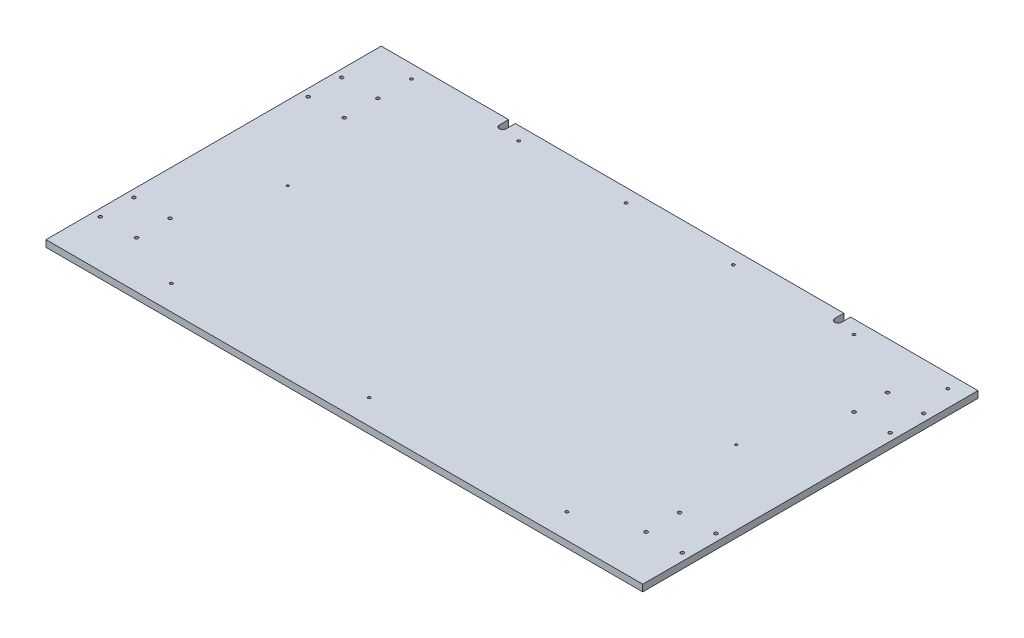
ISO-10303-21;
HEADER;
FILE_DESCRIPTION(('STEP AP214'),'2;1');
FILE_NAME('part.step','',(''),(''),'','','');
FILE_SCHEMA(('AUTOMOTIVE_DESIGN { 1 0 10303 214 1 1 1 1 }'));
ENDSEC;
DATA;
#1=APPLICATION_CONTEXT('core data for automotive mechanical design processes');
#2=APPLICATION_PROTOCOL_DEFINITION('international standard','automotive_design',2000,#1);
#3=PRODUCT_CONTEXT('',#1,'mechanical');
#4=PRODUCT('Part','Part','',(#3));
#5=PRODUCT_RELATED_PRODUCT_CATEGORY('part','',(#4));
#6=PRODUCT_DEFINITION_FORMATION('','',#4);
#7=PRODUCT_DEFINITION_CONTEXT('part definition',#1,'design');
#8=PRODUCT_DEFINITION('design','',#6,#7);
#9=PRODUCT_DEFINITION_SHAPE('','',#8);
#10=(LENGTH_UNIT() NAMED_UNIT(*) SI_UNIT(.MILLI.,.METRE.));
#11=(NAMED_UNIT(*) PLANE_ANGLE_UNIT() SI_UNIT($,.RADIAN.));
#12=(NAMED_UNIT(*) SI_UNIT($,.STERADIAN.) SOLID_ANGLE_UNIT());
#13=UNCERTAINTY_MEASURE_WITH_UNIT(LENGTH_MEASURE(1.E-05),#10,'distance_accuracy_value','');
#14=(GEOMETRIC_REPRESENTATION_CONTEXT(3) GLOBAL_UNCERTAINTY_ASSIGNED_CONTEXT((#13)) GLOBAL_UNIT_ASSIGNED_CONTEXT((#10,
#11,#12)) REPRESENTATION_CONTEXT('',''));
#15=CARTESIAN_POINT('',(0.,0.,0.));
#16=DIRECTION('',(0.,0.,1.));
#17=DIRECTION('',(1.,0.,0.));
#18=AXIS2_PLACEMENT_3D('',#15,#16,#17);
#19=CARTESIAN_POINT('',(0.,10.,0.));
#20=DIRECTION('',(0.,-1.,0.));
#21=DIRECTION('',(0.,0.,-1.));
#22=AXIS2_PLACEMENT_3D('',#19,#20,#21);
#23=PLANE('',#22);
#24=CARTESIAN_POINT('',(-334.5,10.,0.));
#25=DIRECTION('',(0.,1.,0.));
#26=DIRECTION('',(0.,0.,1.));
#27=AXIS2_PLACEMENT_3D('',#24,#25,#26);
#28=CIRCLE('',#27,1.64999999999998);
#29=CARTESIAN_POINT('',(-334.5,10.,1.64999999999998));
#30=VERTEX_POINT('',#29);
#31=EDGE_CURVE('E325',#30,#30,#28,.T.);
#32=ORIENTED_EDGE('',*,*,#31,.F.);
#33=EDGE_LOOP('',(#32));
#34=FACE_BOUND('',#33,.T.);
#35=CARTESIAN_POINT('',(334.5,10.,0.));
#36=DIRECTION('',(0.,1.,0.));
#37=DIRECTION('',(0.,0.,1.));
#38=AXIS2_PLACEMENT_3D('',#35,#36,#37);
#39=CIRCLE('',#38,1.64999999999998);
#40=CARTESIAN_POINT('',(334.5,10.,1.64999999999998));
#41=VERTEX_POINT('',#40);
#42=EDGE_CURVE('E331',#41,#41,#39,.T.);
#43=ORIENTED_EDGE('',*,*,#42,.F.);
#44=EDGE_LOOP('',(#43));
#45=FACE_BOUND('',#44,.T.);
#46=CARTESIAN_POINT('',(-60.0000000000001,10.,-230.));
#47=DIRECTION('',(0.,1.,0.));
#48=DIRECTION('',(0.,0.,1.));
#49=AXIS2_PLACEMENT_3D('',#46,#47,#48);
#50=CIRCLE('',#49,2.09999999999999);
#51=CARTESIAN_POINT('',(-60.0000000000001,10.,-227.9));
#52=VERTEX_POINT('',#51);
#53=EDGE_CURVE('E337',#52,#52,#50,.T.);
#54=ORIENTED_EDGE('',*,*,#53,.F.);
#55=EDGE_LOOP('',(#54));
#56=FACE_BOUND('',#55,.T.);
#57=CARTESIAN_POINT('',(99.9999999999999,10.,-230.));
#58=DIRECTION('',(0.,1.,0.));
#59=DIRECTION('',(0.,0.,1.));
#60=AXIS2_PLACEMENT_3D('',#57,#58,#59);
#61=CIRCLE('',#60,2.09999999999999);
#62=CARTESIAN_POINT('',(99.9999999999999,10.,-227.9));
#63=VERTEX_POINT('',#62);
#64=EDGE_CURVE('E343',#63,#63,#61,.T.);
#65=ORIENTED_EDGE('',*,*,#64,.F.);
#66=EDGE_LOOP('',(#65));
#67=FACE_BOUND('',#66,.T.);
#68=CARTESIAN_POINT('',(280.,10.,-230.));
#69=DIRECTION('',(0.,1.,0.));
#70=DIRECTION('',(0.,0.,1.));
#71=AXIS2_PLACEMENT_3D('',#68,#69,#70);
#72=CIRCLE('',#71,2.09999999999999);
#73=CARTESIAN_POINT('',(280.,10.,-227.9));
#74=VERTEX_POINT('',#73);
#75=EDGE_CURVE('E349',#74,#74,#72,.T.);
#76=ORIENTED_EDGE('',*,*,#75,.F.);
#77=EDGE_LOOP('',(#76));
#78=FACE_BOUND('',#77,.T.);
#79=CARTESIAN_POINT('',(420.,10.,-230.));
#80=DIRECTION('',(0.,1.,0.));
#81=DIRECTION('',(0.,0.,1.));
#82=AXIS2_PLACEMENT_3D('',#79,#80,#81);
#83=CIRCLE('',#82,2.09999999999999);
#84=CARTESIAN_POINT('',(420.,10.,-227.9));
#85=VERTEX_POINT('',#84);
#86=EDGE_CURVE('E355',#85,#85,#83,.T.);
#87=ORIENTED_EDGE('',*,*,#86,.F.);
#88=EDGE_LOOP('',(#87));
#89=FACE_BOUND('',#88,.T.);
#90=CARTESIAN_POINT('',(295.,10.,213.));
#91=DIRECTION('',(0.,1.,0.));
#92=DIRECTION('',(0.,0.,1.));
#93=AXIS2_PLACEMENT_3D('',#90,#91,#92);
#94=CIRCLE('',#93,2.09999999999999);
#95=CARTESIAN_POINT('',(295.,10.,215.1));
#96=VERTEX_POINT('',#95);
#97=EDGE_CURVE('E361',#96,#96,#94,.T.);
#98=ORIENTED_EDGE('',*,*,#97,.F.);
#99=EDGE_LOOP('',(#98));
#100=FACE_BOUND('',#99,.T.);
#101=CARTESIAN_POINT('',(0.,10.,213.));
#102=DIRECTION('',(0.,1.,0.));
#103=DIRECTION('',(0.,0.,1.));
#104=AXIS2_PLACEMENT_3D('',#101,#102,#103);
#105=CIRCLE('',#104,2.09999999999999);
#106=CARTESIAN_POINT('',(0.,10.,215.1));
#107=VERTEX_POINT('',#106);
#108=EDGE_CURVE('E367',#107,#107,#105,.T.);
#109=ORIENTED_EDGE('',*,*,#108,.F.);
#110=EDGE_LOOP('',(#109));
#111=FACE_BOUND('',#110,.T.);
#112=CARTESIAN_POINT('',(-220.,10.,-230.));
#113=DIRECTION('',(0.,1.,0.));
#114=DIRECTION('',(0.,0.,1.));
#115=AXIS2_PLACEMENT_3D('',#112,#113,#114);
#116=CIRCLE('',#115,2.09999999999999);
#117=CARTESIAN_POINT('',(-220.,10.,-227.9));
#118=VERTEX_POINT('',#117);
#119=EDGE_CURVE('E373',#118,#118,#116,.T.);
#120=ORIENTED_EDGE('',*,*,#119,.F.);
#121=EDGE_LOOP('',(#120));
#122=FACE_BOUND('',#121,.T.);
#123=CARTESIAN_POINT('',(-295.,10.,213.));
#124=DIRECTION('',(0.,1.,0.));
#125=DIRECTION('',(0.,0.,1.));
#126=AXIS2_PLACEMENT_3D('',#123,#124,#125);
#127=CIRCLE('',#126,2.09999999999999);
#128=CARTESIAN_POINT('',(-295.,10.,215.1));
#129=VERTEX_POINT('',#128);
#130=EDGE_CURVE('E379',#129,#129,#127,.T.);
#131=ORIENTED_EDGE('',*,*,#130,.F.);
#132=EDGE_LOOP('',(#131));
#133=FACE_BOUND('',#132,.T.);
#134=CARTESIAN_POINT('',(-380.,10.,-230.));
#135=DIRECTION('',(0.,1.,0.));
#136=DIRECTION('',(0.,0.,1.));
#137=AXIS2_PLACEMENT_3D('',#134,#135,#136);
#138=CIRCLE('',#137,2.09999999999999);
#139=CARTESIAN_POINT('',(-380.,10.,-227.9));
#140=VERTEX_POINT('',#139);
#141=EDGE_CURVE('E385',#140,#140,#138,.T.);
#142=ORIENTED_EDGE('',*,*,#141,.F.);
#143=EDGE_LOOP('',(#142));
#144=FACE_BOUND('',#143,.T.);
#145=CARTESIAN_POINT('',(-434.,10.,-180.));
#146=DIRECTION('',(0.,1.,0.));
#147=DIRECTION('',(0.,0.,1.));
#148=AXIS2_PLACEMENT_3D('',#145,#146,#147);
#149=CIRCLE('',#148,2.5);
#150=CARTESIAN_POINT('',(-434.,10.,-177.5));
#151=VERTEX_POINT('',#150);
#152=EDGE_CURVE('E391',#151,#151,#149,.T.);
#153=ORIENTED_EDGE('',*,*,#152,.F.);
#154=EDGE_LOOP('',(#153));
#155=FACE_BOUND('',#154,.T.);
#156=CARTESIAN_POINT('',(-380.,10.,-180.));
#157=DIRECTION('',(0.,1.,0.));
#158=DIRECTION('',(0.,0.,1.));
#159=AXIS2_PLACEMENT_3D('',#156,#157,#158);
#160=CIRCLE('',#159,2.5);
#161=CARTESIAN_POINT('',(-380.,10.,-177.5));
#162=VERTEX_POINT('',#161);
#163=EDGE_CURVE('E397',#162,#162,#160,.T.);
#164=ORIENTED_EDGE('',*,*,#163,.F.);
#165=EDGE_LOOP('',(#164));
#166=FACE_BOUND('',#165,.T.);
#167=CARTESIAN_POINT('',(-380.,10.,-130.));
#168=DIRECTION('',(0.,1.,0.));
#169=DIRECTION('',(0.,0.,1.));
#170=AXIS2_PLACEMENT_3D('',#167,#168,#169);
#171=CIRCLE('',#170,2.5);
#172=CARTESIAN_POINT('',(-380.,10.,-127.5));
#173=VERTEX_POINT('',#172);
#174=EDGE_CURVE('E403',#173,#173,#171,.T.);
#175=ORIENTED_EDGE('',*,*,#174,.F.);
#176=EDGE_LOOP('',(#175));
#177=FACE_BOUND('',#176,.T.);
#178=CARTESIAN_POINT('',(-434.,10.,-130.));
#179=DIRECTION('',(0.,1.,0.));
#180=DIRECTION('',(0.,0.,1.));
#181=AXIS2_PLACEMENT_3D('',#178,#179,#180);
#182=CIRCLE('',#181,2.5);
#183=CARTESIAN_POINT('',(-434.,10.,-127.5));
#184=VERTEX_POINT('',#183);
#185=EDGE_CURVE('E409',#184,#184,#182,.T.);
#186=ORIENTED_EDGE('',*,*,#185,.F.);
#187=EDGE_LOOP('',(#186));
#188=FACE_BOUND('',#187,.T.);
#189=CARTESIAN_POINT('',(-434.,10.,130.));
#190=DIRECTION('',(0.,1.,0.));
#191=DIRECTION('',(0.,0.,1.));
#192=AXIS2_PLACEMENT_3D('',#189,#190,#191);
#193=CIRCLE('',#192,2.5);
#194=CARTESIAN_POINT('',(-434.,10.,132.5));
#195=VERTEX_POINT('',#194);
#196=EDGE_CURVE('E415',#195,#195,#193,.T.);
#197=ORIENTED_EDGE('',*,*,#196,.F.);
#198=EDGE_LOOP('',(#197));
#199=FACE_BOUND('',#198,.T.);
#200=CARTESIAN_POINT('',(-380.,10.,130.));
#201=DIRECTION('',(0.,1.,0.));
#202=DIRECTION('',(0.,0.,1.));
#203=AXIS2_PLACEMENT_3D('',#200,#201,#202);
#204=CIRCLE('',#203,2.5);
#205=CARTESIAN_POINT('',(-380.,10.,132.5));
#206=VERTEX_POINT('',#205);
#207=EDGE_CURVE('E421',#206,#206,#204,.T.);
#208=ORIENTED_EDGE('',*,*,#207,.F.);
#209=EDGE_LOOP('',(#208));
#210=FACE_BOUND('',#209,.T.);
#211=CARTESIAN_POINT('',(-380.,10.,180.));
#212=DIRECTION('',(0.,1.,0.));
#213=DIRECTION('',(0.,0.,1.));
#214=AXIS2_PLACEMENT_3D('',#211,#212,#213);
#215=CIRCLE('',#214,2.5);
#216=CARTESIAN_POINT('',(-380.,10.,182.5));
#217=VERTEX_POINT('',#216);
#218=EDGE_CURVE('E427',#217,#217,#215,.T.);
#219=ORIENTED_EDGE('',*,*,#218,.F.);
#220=EDGE_LOOP('',(#219));
#221=FACE_BOUND('',#220,.T.);
#222=CARTESIAN_POINT('',(-434.,10.,180.));
#223=DIRECTION('',(0.,1.,0.));
#224=DIRECTION('',(0.,0.,1.));
#225=AXIS2_PLACEMENT_3D('',#222,#223,#224);
#226=CIRCLE('',#225,2.5);
#227=CARTESIAN_POINT('',(-434.,10.,182.5));
#228=VERTEX_POINT('',#227);
#229=EDGE_CURVE('E433',#228,#228,#226,.T.);
#230=ORIENTED_EDGE('',*,*,#229,.F.);
#231=EDGE_LOOP('',(#230));
#232=FACE_BOUND('',#231,.T.);
#233=CARTESIAN_POINT('',(434.,10.,180.));
#234=DIRECTION('',(0.,1.,0.));
#235=DIRECTION('',(0.,0.,1.));
#236=AXIS2_PLACEMENT_3D('',#233,#234,#235);
#237=CIRCLE('',#236,2.5);
#238=CARTESIAN_POINT('',(434.,10.,182.5));
#239=VERTEX_POINT('',#238);
#240=EDGE_CURVE('E439',#239,#239,#237,.T.);
#241=ORIENTED_EDGE('',*,*,#240,.F.);
#242=EDGE_LOOP('',(#241));
#243=FACE_BOUND('',#242,.T.);
#244=CARTESIAN_POINT('',(380.,10.,180.));
#245=DIRECTION('',(0.,1.,0.));
#246=DIRECTION('',(0.,0.,1.));
#247=AXIS2_PLACEMENT_3D('',#244,#245,#246);
#248=CIRCLE('',#247,2.5);
#249=CARTESIAN_POINT('',(380.,10.,182.5));
#250=VERTEX_POINT('',#249);
#251=EDGE_CURVE('E445',#250,#250,#248,.T.);
#252=ORIENTED_EDGE('',*,*,#251,.F.);
#253=EDGE_LOOP('',(#252));
#254=FACE_BOUND('',#253,.T.);
#255=CARTESIAN_POINT('',(380.,10.,130.));
#256=DIRECTION('',(0.,1.,0.));
#257=DIRECTION('',(0.,0.,1.));
#258=AXIS2_PLACEMENT_3D('',#255,#256,#257);
#259=CIRCLE('',#258,2.5);
#260=CARTESIAN_POINT('',(380.,10.,132.5));
#261=VERTEX_POINT('',#260);
#262=EDGE_CURVE('E451',#261,#261,#259,.T.);
#263=ORIENTED_EDGE('',*,*,#262,.F.);
#264=EDGE_LOOP('',(#263));
#265=FACE_BOUND('',#264,.T.);
#266=CARTESIAN_POINT('',(434.,10.,130.));
#267=DIRECTION('',(0.,1.,0.));
#268=DIRECTION('',(0.,0.,1.));
#269=AXIS2_PLACEMENT_3D('',#266,#267,#268);
#270=CIRCLE('',#269,2.5);
#271=CARTESIAN_POINT('',(434.,10.,132.5));
#272=VERTEX_POINT('',#271);
#273=EDGE_CURVE('E457',#272,#272,#270,.T.);
#274=ORIENTED_EDGE('',*,*,#273,.F.);
#275=EDGE_LOOP('',(#274));
#276=FACE_BOUND('',#275,.T.);
#277=CARTESIAN_POINT('',(434.,10.,-130.));
#278=DIRECTION('',(0.,1.,0.));
#279=DIRECTION('',(0.,0.,1.));
#280=AXIS2_PLACEMENT_3D('',#277,#278,#279);
#281=CIRCLE('',#280,2.5);
#282=CARTESIAN_POINT('',(434.,10.,-127.5));
#283=VERTEX_POINT('',#282);
#284=EDGE_CURVE('E463',#283,#283,#281,.T.);
#285=ORIENTED_EDGE('',*,*,#284,.F.);
#286=EDGE_LOOP('',(#285));
#287=FACE_BOUND('',#286,.T.);
#288=CARTESIAN_POINT('',(380.,10.,-130.));
#289=DIRECTION('',(0.,1.,0.));
#290=DIRECTION('',(0.,0.,1.));
#291=AXIS2_PLACEMENT_3D('',#288,#289,#290);
#292=CIRCLE('',#291,2.5);
#293=CARTESIAN_POINT('',(380.,10.,-127.5));
#294=VERTEX_POINT('',#293);
#295=EDGE_CURVE('E469',#294,#294,#292,.T.);
#296=ORIENTED_EDGE('',*,*,#295,.F.);
#297=EDGE_LOOP('',(#296));
#298=FACE_BOUND('',#297,.T.);
#299=CARTESIAN_POINT('',(380.,10.,-180.));
#300=DIRECTION('',(0.,1.,0.));
#301=DIRECTION('',(0.,0.,1.));
#302=AXIS2_PLACEMENT_3D('',#299,#300,#301);
#303=CIRCLE('',#302,2.5);
#304=CARTESIAN_POINT('',(380.,10.,-177.5));
#305=VERTEX_POINT('',#304);
#306=EDGE_CURVE('E475',#305,#305,#303,.T.);
#307=ORIENTED_EDGE('',*,*,#306,.F.);
#308=EDGE_LOOP('',(#307));
#309=FACE_BOUND('',#308,.T.);
#310=CARTESIAN_POINT('',(434.,10.,-180.));
#311=DIRECTION('',(0.,1.,0.));
#312=DIRECTION('',(0.,0.,1.));
#313=AXIS2_PLACEMENT_3D('',#310,#311,#312);
#314=CIRCLE('',#313,2.5);
#315=CARTESIAN_POINT('',(434.,10.,-177.5));
#316=VERTEX_POINT('',#315);
#317=EDGE_CURVE('E481',#316,#316,#314,.T.);
#318=ORIENTED_EDGE('',*,*,#317,.F.);
#319=EDGE_LOOP('',(#318));
#320=FACE_BOUND('',#319,.T.);
#321=DIRECTION('',(0.,0.,-1.));
#322=VECTOR('',#321,1.);
#323=CARTESIAN_POINT('',(-244.999999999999,9.99999999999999,-236.2));
#324=LINE('',#323,#322);
#325=CARTESIAN_POINT('',(-244.999999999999,9.99999999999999,-236.2));
#326=VERTEX_POINT('',#325);
#327=CARTESIAN_POINT('',(-244.999999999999,9.99999999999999,-250.));
#328=VERTEX_POINT('',#327);
#329=EDGE_CURVE('E283',#326,#328,#324,.T.);
#330=ORIENTED_EDGE('',*,*,#329,.F.);
#331=CARTESIAN_POINT('',(-249.999999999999,9.99999999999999,-236.2));
#332=DIRECTION('',(0.,-1.,0.));
#333=DIRECTION('',(0.,0.,-1.));
#334=AXIS2_PLACEMENT_3D('',#331,#332,#333);
#335=CIRCLE('',#334,4.99999999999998);
#336=CARTESIAN_POINT('',(-254.999999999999,10.,-236.2));
#337=VERTEX_POINT('',#336);
#338=EDGE_CURVE('E291',#326,#337,#335,.T.);
#339=ORIENTED_EDGE('',*,*,#338,.T.);
#340=DIRECTION('',(0.,0.,-1.));
#341=VECTOR('',#340,1.);
#342=CARTESIAN_POINT('',(-254.999999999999,10.,-236.2));
#343=LINE('',#342,#341);
#344=CARTESIAN_POINT('',(-254.999999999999,10.,-250.));
#345=VERTEX_POINT('',#344);
#346=EDGE_CURVE('E558',#337,#345,#343,.T.);
#347=ORIENTED_EDGE('',*,*,#346,.T.);
#348=DIRECTION('',(-1.,0.,0.));
#349=VECTOR('',#348,1.);
#350=CARTESIAN_POINT('',(445.,10.,-250.));
#351=LINE('',#350,#349);
#352=CARTESIAN_POINT('',(-445.,10.,-250.));
#353=VERTEX_POINT('',#352);
#354=EDGE_CURVE('E496',#345,#353,#351,.T.);
#355=ORIENTED_EDGE('',*,*,#354,.T.);
#356=DIRECTION('',(0.,0.,1.));
#357=VECTOR('',#356,1.);
#358=CARTESIAN_POINT('',(-445.,10.,-250.));
#359=LINE('',#358,#357);
#360=CARTESIAN_POINT('',(-445.,10.,250.));
#361=VERTEX_POINT('',#360);
#362=EDGE_CURVE('E488',#353,#361,#359,.T.);
#363=ORIENTED_EDGE('',*,*,#362,.T.);
#364=DIRECTION('',(1.,0.,0.));
#365=VECTOR('',#364,1.);
#366=CARTESIAN_POINT('',(445.,10.,250.));
#367=LINE('',#366,#365);
#368=CARTESIAN_POINT('',(445.,10.,250.));
#369=VERTEX_POINT('',#368);
#370=EDGE_CURVE('E491',#361,#369,#367,.T.);
#371=ORIENTED_EDGE('',*,*,#370,.T.);
#372=DIRECTION('',(0.,0.,-1.));
#373=VECTOR('',#372,1.);
#374=CARTESIAN_POINT('',(445.,10.,-250.));
#375=LINE('',#374,#373);
#376=CARTESIAN_POINT('',(445.,10.,-250.));
#377=VERTEX_POINT('',#376);
#378=EDGE_CURVE('E494',#369,#377,#375,.T.);
#379=ORIENTED_EDGE('',*,*,#378,.T.);
#380=CARTESIAN_POINT('',(255.000000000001,9.99999999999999,-250.));
#381=VERTEX_POINT('',#380);
#382=EDGE_CURVE('E497',#377,#381,#351,.T.);
#383=ORIENTED_EDGE('',*,*,#382,.T.);
#384=DIRECTION('',(0.,0.,-1.));
#385=VECTOR('',#384,1.);
#386=CARTESIAN_POINT('',(255.000000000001,9.99999999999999,-236.2));
#387=LINE('',#386,#385);
#388=CARTESIAN_POINT('',(255.000000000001,9.99999999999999,-236.2));
#389=VERTEX_POINT('',#388);
#390=EDGE_CURVE('E306',#389,#381,#387,.T.);
#391=ORIENTED_EDGE('',*,*,#390,.F.);
#392=CARTESIAN_POINT('',(250.000000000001,9.99999999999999,-236.2));
#393=DIRECTION('',(0.,-1.,0.));
#394=DIRECTION('',(0.,0.,-1.));
#395=AXIS2_PLACEMENT_3D('',#392,#393,#394);
#396=CIRCLE('',#395,5.);
#397=CARTESIAN_POINT('',(245.000000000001,10.,-236.2));
#398=VERTEX_POINT('',#397);
#399=EDGE_CURVE('E316',#389,#398,#396,.T.);
#400=ORIENTED_EDGE('',*,*,#399,.T.);
#401=DIRECTION('',(0.,0.,-1.));
#402=VECTOR('',#401,1.);
#403=CARTESIAN_POINT('',(245.000000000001,9.99999999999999,-236.2));
#404=LINE('',#403,#402);
#405=CARTESIAN_POINT('',(245.000000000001,9.99999999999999,-250.));
#406=VERTEX_POINT('',#405);
#407=EDGE_CURVE('E303',#398,#406,#404,.T.);
#408=ORIENTED_EDGE('',*,*,#407,.T.);
#409=EDGE_CURVE('E501',#406,#328,#351,.T.);
#410=ORIENTED_EDGE('',*,*,#409,.T.);
#411=EDGE_LOOP('',(#330,#339,#347,#355,#363,#371,#379,#383,#391,#400,#408,#410));
#412=FACE_BOUND('',#411,.T.);
#413=ADVANCED_FACE('F185',(#34,#45,#56,#67,#78,#89,#100,#111,#122,#133,#144,#155,#166,#177,#188,
#199,#210,#221,#232,#243,#254,#265,#276,#287,#298,#309,#320,#412),#23,.F.);
#414=CARTESIAN_POINT('',(445.,10.,-250.));
#415=DIRECTION('',(0.,0.,1.));
#416=DIRECTION('',(1.,0.,0.));
#417=AXIS2_PLACEMENT_3D('',#414,#415,#416);
#418=PLANE('',#417);
#419=DIRECTION('',(0.,-1.,0.));
#420=VECTOR('',#419,1.);
#421=CARTESIAN_POINT('',(-244.999999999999,10.,-250.));
#422=LINE('',#421,#420);
#423=CARTESIAN_POINT('',(-244.999999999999,0.,-250.));
#424=VERTEX_POINT('',#423);
#425=EDGE_CURVE('E13',#328,#424,#422,.T.);
#426=ORIENTED_EDGE('',*,*,#425,.F.);
#427=ORIENTED_EDGE('',*,*,#409,.F.);
#428=DIRECTION('',(0.,-1.,0.));
#429=VECTOR('',#428,1.);
#430=CARTESIAN_POINT('',(245.000000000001,10.,-250.));
#431=LINE('',#430,#429);
#432=CARTESIAN_POINT('',(245.000000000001,0.,-250.));
#433=VERTEX_POINT('',#432);
#434=EDGE_CURVE('E320',#406,#433,#431,.T.);
#435=ORIENTED_EDGE('',*,*,#434,.T.);
#436=DIRECTION('',(-1.,0.,0.));
#437=VECTOR('',#436,1.);
#438=CARTESIAN_POINT('',(445.,0.,-250.));
#439=LINE('',#438,#437);
#440=EDGE_CURVE('E511',#433,#424,#439,.T.);
#441=ORIENTED_EDGE('',*,*,#440,.T.);
#442=EDGE_LOOP('',(#426,#427,#435,#441));
#443=FACE_BOUND('',#442,.T.);
#444=ADVANCED_FACE('F529',(#443),#418,.F.);
#445=DIRECTION('',(0.,-1.,0.));
#446=VECTOR('',#445,1.);
#447=CARTESIAN_POINT('',(255.000000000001,10.,-250.));
#448=LINE('',#447,#446);
#449=CARTESIAN_POINT('',(255.000000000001,0.,-250.));
#450=VERTEX_POINT('',#449);
#451=EDGE_CURVE('E323',#381,#450,#448,.T.);
#452=ORIENTED_EDGE('',*,*,#451,.F.);
#453=ORIENTED_EDGE('',*,*,#382,.F.);
#454=DIRECTION('',(0.,-1.,0.));
#455=VECTOR('',#454,1.);
#456=CARTESIAN_POINT('',(445.,10.,-250.));
#457=LINE('',#456,#455);
#458=CARTESIAN_POINT('',(445.,0.,-250.));
#459=VERTEX_POINT('',#458);
#460=EDGE_CURVE('E514',#377,#459,#457,.T.);
#461=ORIENTED_EDGE('',*,*,#460,.T.);
#462=EDGE_CURVE('E492',#459,#450,#439,.T.);
#463=ORIENTED_EDGE('',*,*,#462,.T.);
#464=EDGE_LOOP('',(#452,#453,#461,#463));
#465=FACE_BOUND('',#464,.T.);
#466=ADVANCED_FACE('F547',(#465),#418,.F.);
#467=CARTESIAN_POINT('',(0.,0.,0.));
#468=DIRECTION('',(0.,-1.,0.));
#469=DIRECTION('',(0.,0.,-1.));
#470=AXIS2_PLACEMENT_3D('',#467,#468,#469);
#471=PLANE('',#470);
#472=DIRECTION('',(0.,0.,-1.));
#473=VECTOR('',#472,1.);
#474=CARTESIAN_POINT('',(-254.999999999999,0.,-236.2));
#475=LINE('',#474,#473);
#476=CARTESIAN_POINT('',(-254.999999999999,0.,-236.2));
#477=VERTEX_POINT('',#476);
#478=CARTESIAN_POINT('',(-254.999999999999,0.,-250.));
#479=VERTEX_POINT('',#478);
#480=EDGE_CURVE('E200',#477,#479,#475,.T.);
#481=ORIENTED_EDGE('',*,*,#480,.F.);
#482=CARTESIAN_POINT('',(-249.999999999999,0.,-236.2));
#483=DIRECTION('',(0.,-1.,0.));
#484=DIRECTION('',(0.,0.,-1.));
#485=AXIS2_PLACEMENT_3D('',#482,#483,#484);
#486=CIRCLE('',#485,4.99999999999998);
#487=CARTESIAN_POINT('',(-244.999999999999,0.,-236.2));
#488=VERTEX_POINT('',#487);
#489=EDGE_CURVE('E289',#488,#477,#486,.T.);
#490=ORIENTED_EDGE('',*,*,#489,.F.);
#491=DIRECTION('',(0.,0.,-1.));
#492=VECTOR('',#491,1.);
#493=CARTESIAN_POINT('',(-244.999999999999,0.,-236.2));
#494=LINE('',#493,#492);
#495=EDGE_CURVE('E273',#488,#424,#494,.T.);
#496=ORIENTED_EDGE('',*,*,#495,.T.);
#497=ORIENTED_EDGE('',*,*,#440,.F.);
#498=DIRECTION('',(0.,0.,-1.));
#499=VECTOR('',#498,1.);
#500=CARTESIAN_POINT('',(245.000000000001,0.,-236.2));
#501=LINE('',#500,#499);
#502=CARTESIAN_POINT('',(245.000000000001,0.,-236.2));
#503=VERTEX_POINT('',#502);
#504=EDGE_CURVE('E301',#503,#433,#501,.T.);
#505=ORIENTED_EDGE('',*,*,#504,.F.);
#506=CARTESIAN_POINT('',(250.000000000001,0.,-236.2));
#507=DIRECTION('',(0.,-1.,0.));
#508=DIRECTION('',(0.,0.,-1.));
#509=AXIS2_PLACEMENT_3D('',#506,#507,#508);
#510=CIRCLE('',#509,5.);
#511=CARTESIAN_POINT('',(255.000000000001,0.,-236.2));
#512=VERTEX_POINT('',#511);
#513=EDGE_CURVE('E314',#512,#503,#510,.T.);
#514=ORIENTED_EDGE('',*,*,#513,.F.);
#515=DIRECTION('',(0.,0.,-1.));
#516=VECTOR('',#515,1.);
#517=CARTESIAN_POINT('',(255.000000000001,0.,-236.2));
#518=LINE('',#517,#516);
#519=EDGE_CURVE('E308',#512,#450,#518,.T.);
#520=ORIENTED_EDGE('',*,*,#519,.T.);
#521=ORIENTED_EDGE('',*,*,#462,.F.);
#522=DIRECTION('',(0.,0.,-1.));
#523=VECTOR('',#522,1.);
#524=CARTESIAN_POINT('',(445.,0.,-250.));
#525=LINE('',#524,#523);
#526=CARTESIAN_POINT('',(445.,0.,250.));
#527=VERTEX_POINT('',#526);
#528=EDGE_CURVE('E506',#527,#459,#525,.T.);
#529=ORIENTED_EDGE('',*,*,#528,.F.);
#530=DIRECTION('',(1.,0.,0.));
#531=VECTOR('',#530,1.);
#532=CARTESIAN_POINT('',(445.,0.,250.));
#533=LINE('',#532,#531);
#534=CARTESIAN_POINT('',(-445.,0.,250.));
#535=VERTEX_POINT('',#534);
#536=EDGE_CURVE('E504',#535,#527,#533,.T.);
#537=ORIENTED_EDGE('',*,*,#536,.F.);
#538=DIRECTION('',(0.,0.,1.));
#539=VECTOR('',#538,1.);
#540=CARTESIAN_POINT('',(-445.,0.,-250.));
#541=LINE('',#540,#539);
#542=CARTESIAN_POINT('',(-445.,0.,-250.));
#543=VERTEX_POINT('',#542);
#544=EDGE_CURVE('E487',#543,#535,#541,.T.);
#545=ORIENTED_EDGE('',*,*,#544,.F.);
#546=EDGE_CURVE('E508',#479,#543,#439,.T.);
#547=ORIENTED_EDGE('',*,*,#546,.F.);
#548=EDGE_LOOP('',(#481,#490,#496,#497,#505,#514,#520,#521,#529,#537,#545,#547));
#549=FACE_BOUND('',#548,.T.);
#550=CARTESIAN_POINT('',(434.,0.,-180.));
#551=DIRECTION('',(0.,1.,0.));
#552=DIRECTION('',(0.,0.,1.));
#553=AXIS2_PLACEMENT_3D('',#550,#551,#552);
#554=CIRCLE('',#553,2.5);
#555=CARTESIAN_POINT('',(434.,0.,-177.5));
#556=VERTEX_POINT('',#555);
#557=EDGE_CURVE('E484',#556,#556,#554,.T.);
#558=ORIENTED_EDGE('',*,*,#557,.T.);
#559=EDGE_LOOP('',(#558));
#560=FACE_BOUND('',#559,.T.);
#561=CARTESIAN_POINT('',(380.,0.,-180.));
#562=DIRECTION('',(0.,1.,0.));
#563=DIRECTION('',(0.,0.,1.));
#564=AXIS2_PLACEMENT_3D('',#561,#562,#563);
#565=CIRCLE('',#564,2.5);
#566=CARTESIAN_POINT('',(380.,0.,-177.5));
#567=VERTEX_POINT('',#566);
#568=EDGE_CURVE('E478',#567,#567,#565,.T.);
#569=ORIENTED_EDGE('',*,*,#568,.T.);
#570=EDGE_LOOP('',(#569));
#571=FACE_BOUND('',#570,.T.);
#572=CARTESIAN_POINT('',(380.,0.,-130.));
#573=DIRECTION('',(0.,1.,0.));
#574=DIRECTION('',(0.,0.,1.));
#575=AXIS2_PLACEMENT_3D('',#572,#573,#574);
#576=CIRCLE('',#575,2.5);
#577=CARTESIAN_POINT('',(380.,0.,-127.5));
#578=VERTEX_POINT('',#577);
#579=EDGE_CURVE('E472',#578,#578,#576,.T.);
#580=ORIENTED_EDGE('',*,*,#579,.T.);
#581=EDGE_LOOP('',(#580));
#582=FACE_BOUND('',#581,.T.);
#583=CARTESIAN_POINT('',(434.,0.,-130.));
#584=DIRECTION('',(0.,1.,0.));
#585=DIRECTION('',(0.,0.,1.));
#586=AXIS2_PLACEMENT_3D('',#583,#584,#585);
#587=CIRCLE('',#586,2.5);
#588=CARTESIAN_POINT('',(434.,0.,-127.5));
#589=VERTEX_POINT('',#588);
#590=EDGE_CURVE('E466',#589,#589,#587,.T.);
#591=ORIENTED_EDGE('',*,*,#590,.T.);
#592=EDGE_LOOP('',(#591));
#593=FACE_BOUND('',#592,.T.);
#594=CARTESIAN_POINT('',(434.,0.,130.));
#595=DIRECTION('',(0.,1.,0.));
#596=DIRECTION('',(0.,0.,1.));
#597=AXIS2_PLACEMENT_3D('',#594,#595,#596);
#598=CIRCLE('',#597,2.5);
#599=CARTESIAN_POINT('',(434.,0.,132.5));
#600=VERTEX_POINT('',#599);
#601=EDGE_CURVE('E460',#600,#600,#598,.T.);
#602=ORIENTED_EDGE('',*,*,#601,.T.);
#603=EDGE_LOOP('',(#602));
#604=FACE_BOUND('',#603,.T.);
#605=CARTESIAN_POINT('',(380.,0.,130.));
#606=DIRECTION('',(0.,1.,0.));
#607=DIRECTION('',(0.,0.,1.));
#608=AXIS2_PLACEMENT_3D('',#605,#606,#607);
#609=CIRCLE('',#608,2.5);
#610=CARTESIAN_POINT('',(380.,0.,132.5));
#611=VERTEX_POINT('',#610);
#612=EDGE_CURVE('E454',#611,#611,#609,.T.);
#613=ORIENTED_EDGE('',*,*,#612,.T.);
#614=EDGE_LOOP('',(#613));
#615=FACE_BOUND('',#614,.T.);
#616=CARTESIAN_POINT('',(380.,0.,180.));
#617=DIRECTION('',(0.,1.,0.));
#618=DIRECTION('',(0.,0.,1.));
#619=AXIS2_PLACEMENT_3D('',#616,#617,#618);
#620=CIRCLE('',#619,2.5);
#621=CARTESIAN_POINT('',(380.,0.,182.5));
#622=VERTEX_POINT('',#621);
#623=EDGE_CURVE('E448',#622,#622,#620,.T.);
#624=ORIENTED_EDGE('',*,*,#623,.T.);
#625=EDGE_LOOP('',(#624));
#626=FACE_BOUND('',#625,.T.);
#627=CARTESIAN_POINT('',(434.,0.,180.));
#628=DIRECTION('',(0.,1.,0.));
#629=DIRECTION('',(0.,0.,1.));
#630=AXIS2_PLACEMENT_3D('',#627,#628,#629);
#631=CIRCLE('',#630,2.5);
#632=CARTESIAN_POINT('',(434.,0.,182.5));
#633=VERTEX_POINT('',#632);
#634=EDGE_CURVE('E442',#633,#633,#631,.T.);
#635=ORIENTED_EDGE('',*,*,#634,.T.);
#636=EDGE_LOOP('',(#635));
#637=FACE_BOUND('',#636,.T.);
#638=CARTESIAN_POINT('',(-434.,0.,180.));
#639=DIRECTION('',(0.,1.,0.));
#640=DIRECTION('',(0.,0.,1.));
#641=AXIS2_PLACEMENT_3D('',#638,#639,#640);
#642=CIRCLE('',#641,2.5);
#643=CARTESIAN_POINT('',(-434.,0.,182.5));
#644=VERTEX_POINT('',#643);
#645=EDGE_CURVE('E436',#644,#644,#642,.T.);
#646=ORIENTED_EDGE('',*,*,#645,.T.);
#647=EDGE_LOOP('',(#646));
#648=FACE_BOUND('',#647,.T.);
#649=CARTESIAN_POINT('',(-380.,0.,180.));
#650=DIRECTION('',(0.,1.,0.));
#651=DIRECTION('',(0.,0.,1.));
#652=AXIS2_PLACEMENT_3D('',#649,#650,#651);
#653=CIRCLE('',#652,2.5);
#654=CARTESIAN_POINT('',(-380.,0.,182.5));
#655=VERTEX_POINT('',#654);
#656=EDGE_CURVE('E430',#655,#655,#653,.T.);
#657=ORIENTED_EDGE('',*,*,#656,.T.);
#658=EDGE_LOOP('',(#657));
#659=FACE_BOUND('',#658,.T.);
#660=CARTESIAN_POINT('',(-380.,0.,130.));
#661=DIRECTION('',(0.,1.,0.));
#662=DIRECTION('',(0.,0.,1.));
#663=AXIS2_PLACEMENT_3D('',#660,#661,#662);
#664=CIRCLE('',#663,2.5);
#665=CARTESIAN_POINT('',(-380.,0.,132.5));
#666=VERTEX_POINT('',#665);
#667=EDGE_CURVE('E424',#666,#666,#664,.T.);
#668=ORIENTED_EDGE('',*,*,#667,.T.);
#669=EDGE_LOOP('',(#668));
#670=FACE_BOUND('',#669,.T.);
#671=CARTESIAN_POINT('',(-434.,0.,130.));
#672=DIRECTION('',(0.,1.,0.));
#673=DIRECTION('',(0.,0.,1.));
#674=AXIS2_PLACEMENT_3D('',#671,#672,#673);
#675=CIRCLE('',#674,2.5);
#676=CARTESIAN_POINT('',(-434.,0.,132.5));
#677=VERTEX_POINT('',#676);
#678=EDGE_CURVE('E418',#677,#677,#675,.T.);
#679=ORIENTED_EDGE('',*,*,#678,.T.);
#680=EDGE_LOOP('',(#679));
#681=FACE_BOUND('',#680,.T.);
#682=CARTESIAN_POINT('',(-434.,0.,-130.));
#683=DIRECTION('',(0.,1.,0.));
#684=DIRECTION('',(0.,0.,1.));
#685=AXIS2_PLACEMENT_3D('',#682,#683,#684);
#686=CIRCLE('',#685,2.5);
#687=CARTESIAN_POINT('',(-434.,0.,-127.5));
#688=VERTEX_POINT('',#687);
#689=EDGE_CURVE('E412',#688,#688,#686,.T.);
#690=ORIENTED_EDGE('',*,*,#689,.T.);
#691=EDGE_LOOP('',(#690));
#692=FACE_BOUND('',#691,.T.);
#693=CARTESIAN_POINT('',(-380.,0.,-130.));
#694=DIRECTION('',(0.,1.,0.));
#695=DIRECTION('',(0.,0.,1.));
#696=AXIS2_PLACEMENT_3D('',#693,#694,#695);
#697=CIRCLE('',#696,2.5);
#698=CARTESIAN_POINT('',(-380.,0.,-127.5));
#699=VERTEX_POINT('',#698);
#700=EDGE_CURVE('E406',#699,#699,#697,.T.);
#701=ORIENTED_EDGE('',*,*,#700,.T.);
#702=EDGE_LOOP('',(#701));
#703=FACE_BOUND('',#702,.T.);
#704=CARTESIAN_POINT('',(-380.,0.,-180.));
#705=DIRECTION('',(0.,1.,0.));
#706=DIRECTION('',(0.,0.,1.));
#707=AXIS2_PLACEMENT_3D('',#704,#705,#706);
#708=CIRCLE('',#707,2.5);
#709=CARTESIAN_POINT('',(-380.,0.,-177.5));
#710=VERTEX_POINT('',#709);
#711=EDGE_CURVE('E400',#710,#710,#708,.T.);
#712=ORIENTED_EDGE('',*,*,#711,.T.);
#713=EDGE_LOOP('',(#712));
#714=FACE_BOUND('',#713,.T.);
#715=CARTESIAN_POINT('',(-434.,0.,-180.));
#716=DIRECTION('',(0.,1.,0.));
#717=DIRECTION('',(0.,0.,1.));
#718=AXIS2_PLACEMENT_3D('',#715,#716,#717);
#719=CIRCLE('',#718,2.5);
#720=CARTESIAN_POINT('',(-434.,0.,-177.5));
#721=VERTEX_POINT('',#720);
#722=EDGE_CURVE('E394',#721,#721,#719,.T.);
#723=ORIENTED_EDGE('',*,*,#722,.T.);
#724=EDGE_LOOP('',(#723));
#725=FACE_BOUND('',#724,.T.);
#726=CARTESIAN_POINT('',(-380.,0.,-230.));
#727=DIRECTION('',(0.,1.,0.));
#728=DIRECTION('',(0.,0.,1.));
#729=AXIS2_PLACEMENT_3D('',#726,#727,#728);
#730=CIRCLE('',#729,2.09999999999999);
#731=CARTESIAN_POINT('',(-380.,0.,-227.9));
#732=VERTEX_POINT('',#731);
#733=EDGE_CURVE('E388',#732,#732,#730,.T.);
#734=ORIENTED_EDGE('',*,*,#733,.T.);
#735=EDGE_LOOP('',(#734));
#736=FACE_BOUND('',#735,.T.);
#737=CARTESIAN_POINT('',(-295.,0.,213.));
#738=DIRECTION('',(0.,1.,0.));
#739=DIRECTION('',(0.,0.,1.));
#740=AXIS2_PLACEMENT_3D('',#737,#738,#739);
#741=CIRCLE('',#740,2.09999999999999);
#742=CARTESIAN_POINT('',(-295.,0.,215.1));
#743=VERTEX_POINT('',#742);
#744=EDGE_CURVE('E382',#743,#743,#741,.T.);
#745=ORIENTED_EDGE('',*,*,#744,.T.);
#746=EDGE_LOOP('',(#745));
#747=FACE_BOUND('',#746,.T.);
#748=CARTESIAN_POINT('',(-220.,0.,-230.));
#749=DIRECTION('',(0.,1.,0.));
#750=DIRECTION('',(0.,0.,1.));
#751=AXIS2_PLACEMENT_3D('',#748,#749,#750);
#752=CIRCLE('',#751,2.09999999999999);
#753=CARTESIAN_POINT('',(-220.,0.,-227.9));
#754=VERTEX_POINT('',#753);
#755=EDGE_CURVE('E376',#754,#754,#752,.T.);
#756=ORIENTED_EDGE('',*,*,#755,.T.);
#757=EDGE_LOOP('',(#756));
#758=FACE_BOUND('',#757,.T.);
#759=CARTESIAN_POINT('',(0.,0.,213.));
#760=DIRECTION('',(0.,1.,0.));
#761=DIRECTION('',(0.,0.,1.));
#762=AXIS2_PLACEMENT_3D('',#759,#760,#761);
#763=CIRCLE('',#762,2.09999999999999);
#764=CARTESIAN_POINT('',(0.,0.,215.1));
#765=VERTEX_POINT('',#764);
#766=EDGE_CURVE('E370',#765,#765,#763,.T.);
#767=ORIENTED_EDGE('',*,*,#766,.T.);
#768=EDGE_LOOP('',(#767));
#769=FACE_BOUND('',#768,.T.);
#770=CARTESIAN_POINT('',(295.,0.,213.));
#771=DIRECTION('',(0.,1.,0.));
#772=DIRECTION('',(0.,0.,1.));
#773=AXIS2_PLACEMENT_3D('',#770,#771,#772);
#774=CIRCLE('',#773,2.09999999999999);
#775=CARTESIAN_POINT('',(295.,0.,215.1));
#776=VERTEX_POINT('',#775);
#777=EDGE_CURVE('E364',#776,#776,#774,.T.);
#778=ORIENTED_EDGE('',*,*,#777,.T.);
#779=EDGE_LOOP('',(#778));
#780=FACE_BOUND('',#779,.T.);
#781=CARTESIAN_POINT('',(420.,0.,-230.));
#782=DIRECTION('',(0.,1.,0.));
#783=DIRECTION('',(0.,0.,1.));
#784=AXIS2_PLACEMENT_3D('',#781,#782,#783);
#785=CIRCLE('',#784,2.09999999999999);
#786=CARTESIAN_POINT('',(420.,0.,-227.9));
#787=VERTEX_POINT('',#786);
#788=EDGE_CURVE('E358',#787,#787,#785,.T.);
#789=ORIENTED_EDGE('',*,*,#788,.T.);
#790=EDGE_LOOP('',(#789));
#791=FACE_BOUND('',#790,.T.);
#792=CARTESIAN_POINT('',(280.,0.,-230.));
#793=DIRECTION('',(0.,1.,0.));
#794=DIRECTION('',(0.,0.,1.));
#795=AXIS2_PLACEMENT_3D('',#792,#793,#794);
#796=CIRCLE('',#795,2.09999999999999);
#797=CARTESIAN_POINT('',(280.,0.,-227.9));
#798=VERTEX_POINT('',#797);
#799=EDGE_CURVE('E352',#798,#798,#796,.T.);
#800=ORIENTED_EDGE('',*,*,#799,.T.);
#801=EDGE_LOOP('',(#800));
#802=FACE_BOUND('',#801,.T.);
#803=CARTESIAN_POINT('',(99.9999999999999,0.,-230.));
#804=DIRECTION('',(0.,1.,0.));
#805=DIRECTION('',(0.,0.,1.));
#806=AXIS2_PLACEMENT_3D('',#803,#804,#805);
#807=CIRCLE('',#806,2.09999999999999);
#808=CARTESIAN_POINT('',(99.9999999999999,0.,-227.9));
#809=VERTEX_POINT('',#808);
#810=EDGE_CURVE('E346',#809,#809,#807,.T.);
#811=ORIENTED_EDGE('',*,*,#810,.T.);
#812=EDGE_LOOP('',(#811));
#813=FACE_BOUND('',#812,.T.);
#814=CARTESIAN_POINT('',(-60.0000000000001,0.,-230.));
#815=DIRECTION('',(0.,1.,0.));
#816=DIRECTION('',(0.,0.,1.));
#817=AXIS2_PLACEMENT_3D('',#814,#815,#816);
#818=CIRCLE('',#817,2.09999999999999);
#819=CARTESIAN_POINT('',(-60.0000000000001,0.,-227.9));
#820=VERTEX_POINT('',#819);
#821=EDGE_CURVE('E340',#820,#820,#818,.T.);
#822=ORIENTED_EDGE('',*,*,#821,.T.);
#823=EDGE_LOOP('',(#822));
#824=FACE_BOUND('',#823,.T.);
#825=CARTESIAN_POINT('',(334.5,0.,0.));
#826=DIRECTION('',(0.,1.,0.));
#827=DIRECTION('',(0.,0.,1.));
#828=AXIS2_PLACEMENT_3D('',#825,#826,#827);
#829=CIRCLE('',#828,1.64999999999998);
#830=CARTESIAN_POINT('',(334.5,0.,1.64999999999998));
#831=VERTEX_POINT('',#830);
#832=EDGE_CURVE('E334',#831,#831,#829,.T.);
#833=ORIENTED_EDGE('',*,*,#832,.T.);
#834=EDGE_LOOP('',(#833));
#835=FACE_BOUND('',#834,.T.);
#836=CARTESIAN_POINT('',(-334.5,0.,0.));
#837=DIRECTION('',(0.,1.,0.));
#838=DIRECTION('',(0.,0.,1.));
#839=AXIS2_PLACEMENT_3D('',#836,#837,#838);
#840=CIRCLE('',#839,1.64999999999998);
#841=CARTESIAN_POINT('',(-334.5,0.,1.64999999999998));
#842=VERTEX_POINT('',#841);
#843=EDGE_CURVE('E328',#842,#842,#840,.T.);
#844=ORIENTED_EDGE('',*,*,#843,.T.);
#845=EDGE_LOOP('',(#844));
#846=FACE_BOUND('',#845,.T.);
#847=ADVANCED_FACE('F293',(#549,#560,#571,#582,#593,#604,#615,#626,#637,#648,#659,#670,#681,
#692,#703,#714,#725,#736,#747,#758,#769,#780,#791,#802,#813,#824,#835,#846),#471,.T.);
#848=CARTESIAN_POINT('',(-445.,10.,-250.));
#849=DIRECTION('',(1.,0.,0.));
#850=DIRECTION('',(0.,0.,-1.));
#851=AXIS2_PLACEMENT_3D('',#848,#849,#850);
#852=PLANE('',#851);
#853=ORIENTED_EDGE('',*,*,#544,.T.);
#854=DIRECTION('',(0.,-1.,0.));
#855=VECTOR('',#854,1.);
#856=CARTESIAN_POINT('',(-445.,10.,250.));
#857=LINE('',#856,#855);
#858=EDGE_CURVE('E520',#361,#535,#857,.T.);
#859=ORIENTED_EDGE('',*,*,#858,.F.);
#860=ORIENTED_EDGE('',*,*,#362,.F.);
#861=DIRECTION('',(0.,-1.,0.));
#862=VECTOR('',#861,1.);
#863=CARTESIAN_POINT('',(-445.,10.,-250.));
#864=LINE('',#863,#862);
#865=EDGE_CURVE('E500',#353,#543,#864,.T.);
#866=ORIENTED_EDGE('',*,*,#865,.T.);
#867=EDGE_LOOP('',(#853,#859,#860,#866));
#868=FACE_BOUND('',#867,.T.);
#869=ADVANCED_FACE('F187',(#868),#852,.F.);
#870=CARTESIAN_POINT('',(445.,10.,250.));
#871=DIRECTION('',(0.,0.,-1.));
#872=DIRECTION('',(-1.,0.,0.));
#873=AXIS2_PLACEMENT_3D('',#870,#871,#872);
#874=PLANE('',#873);
#875=ORIENTED_EDGE('',*,*,#536,.T.);
#876=DIRECTION('',(0.,-1.,0.));
#877=VECTOR('',#876,1.);
#878=CARTESIAN_POINT('',(445.,10.,250.));
#879=LINE('',#878,#877);
#880=EDGE_CURVE('E517',#369,#527,#879,.T.);
#881=ORIENTED_EDGE('',*,*,#880,.F.);
#882=ORIENTED_EDGE('',*,*,#370,.F.);
#883=ORIENTED_EDGE('',*,*,#858,.T.);
#884=EDGE_LOOP('',(#875,#881,#882,#883));
#885=FACE_BOUND('',#884,.T.);
#886=ADVANCED_FACE('F554',(#885),#874,.F.);
#887=CARTESIAN_POINT('',(445.,10.,-250.));
#888=DIRECTION('',(-1.,0.,0.));
#889=DIRECTION('',(0.,0.,1.));
#890=AXIS2_PLACEMENT_3D('',#887,#888,#889);
#891=PLANE('',#890);
#892=ORIENTED_EDGE('',*,*,#528,.T.);
#893=ORIENTED_EDGE('',*,*,#460,.F.);
#894=ORIENTED_EDGE('',*,*,#378,.F.);
#895=ORIENTED_EDGE('',*,*,#880,.T.);
#896=EDGE_LOOP('',(#892,#893,#894,#895));
#897=FACE_BOUND('',#896,.T.);
#898=ADVANCED_FACE('F551',(#897),#891,.F.);
#899=ORIENTED_EDGE('',*,*,#354,.F.);
#900=DIRECTION('',(0.,-1.,0.));
#901=VECTOR('',#900,1.);
#902=CARTESIAN_POINT('',(-254.999999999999,10.,-250.));
#903=LINE('',#902,#901);
#904=EDGE_CURVE('E193',#345,#479,#903,.T.);
#905=ORIENTED_EDGE('',*,*,#904,.T.);
#906=ORIENTED_EDGE('',*,*,#546,.T.);
#907=ORIENTED_EDGE('',*,*,#865,.F.);
#908=EDGE_LOOP('',(#899,#905,#906,#907));
#909=FACE_BOUND('',#908,.T.);
#910=ADVANCED_FACE('F524',(#909),#418,.F.);
#911=CARTESIAN_POINT('',(434.,10.,-180.));
#912=DIRECTION('',(0.,1.,0.));
#913=DIRECTION('',(0.,0.,1.));
#914=AXIS2_PLACEMENT_3D('',#911,#912,#913);
#915=CYLINDRICAL_SURFACE('',#914,2.5);
#916=ORIENTED_EDGE('',*,*,#557,.F.);
#917=EDGE_LOOP('',(#916));
#918=FACE_BOUND('',#917,.T.);
#919=ORIENTED_EDGE('',*,*,#317,.T.);
#920=EDGE_LOOP('',(#919));
#921=FACE_BOUND('',#920,.T.);
#922=ADVANCED_FACE('F582',(#918,#921),#915,.F.);
#923=CARTESIAN_POINT('',(380.,10.,-180.));
#924=DIRECTION('',(0.,1.,0.));
#925=DIRECTION('',(0.,0.,1.));
#926=AXIS2_PLACEMENT_3D('',#923,#924,#925);
#927=CYLINDRICAL_SURFACE('',#926,2.5);
#928=ORIENTED_EDGE('',*,*,#568,.F.);
#929=EDGE_LOOP('',(#928));
#930=FACE_BOUND('',#929,.T.);
#931=ORIENTED_EDGE('',*,*,#306,.T.);
#932=EDGE_LOOP('',(#931));
#933=FACE_BOUND('',#932,.T.);
#934=ADVANCED_FACE('F625',(#930,#933),#927,.F.);
#935=CARTESIAN_POINT('',(380.,10.,-130.));
#936=DIRECTION('',(0.,1.,0.));
#937=DIRECTION('',(0.,0.,1.));
#938=AXIS2_PLACEMENT_3D('',#935,#936,#937);
#939=CYLINDRICAL_SURFACE('',#938,2.5);
#940=ORIENTED_EDGE('',*,*,#579,.F.);
#941=EDGE_LOOP('',(#940));
#942=FACE_BOUND('',#941,.T.);
#943=ORIENTED_EDGE('',*,*,#295,.T.);
#944=EDGE_LOOP('',(#943));
#945=FACE_BOUND('',#944,.T.);
#946=ADVANCED_FACE('F633',(#942,#945),#939,.F.);
#947=CARTESIAN_POINT('',(434.,10.,-130.));
#948=DIRECTION('',(0.,1.,0.));
#949=DIRECTION('',(0.,0.,1.));
#950=AXIS2_PLACEMENT_3D('',#947,#948,#949);
#951=CYLINDRICAL_SURFACE('',#950,2.5);
#952=ORIENTED_EDGE('',*,*,#590,.F.);
#953=EDGE_LOOP('',(#952));
#954=FACE_BOUND('',#953,.T.);
#955=ORIENTED_EDGE('',*,*,#284,.T.);
#956=EDGE_LOOP('',(#955));
#957=FACE_BOUND('',#956,.T.);
#958=ADVANCED_FACE('F640',(#954,#957),#951,.F.);
#959=CARTESIAN_POINT('',(434.,10.,130.));
#960=DIRECTION('',(0.,1.,0.));
#961=DIRECTION('',(0.,0.,1.));
#962=AXIS2_PLACEMENT_3D('',#959,#960,#961);
#963=CYLINDRICAL_SURFACE('',#962,2.5);
#964=ORIENTED_EDGE('',*,*,#601,.F.);
#965=EDGE_LOOP('',(#964));
#966=FACE_BOUND('',#965,.T.);
#967=ORIENTED_EDGE('',*,*,#273,.T.);
#968=EDGE_LOOP('',(#967));
#969=FACE_BOUND('',#968,.T.);
#970=ADVANCED_FACE('F648',(#966,#969),#963,.F.);
#971=CARTESIAN_POINT('',(380.,10.,130.));
#972=DIRECTION('',(0.,1.,0.));
#973=DIRECTION('',(0.,0.,1.));
#974=AXIS2_PLACEMENT_3D('',#971,#972,#973);
#975=CYLINDRICAL_SURFACE('',#974,2.5);
#976=ORIENTED_EDGE('',*,*,#612,.F.);
#977=EDGE_LOOP('',(#976));
#978=FACE_BOUND('',#977,.T.);
#979=ORIENTED_EDGE('',*,*,#262,.T.);
#980=EDGE_LOOP('',(#979));
#981=FACE_BOUND('',#980,.T.);
#982=ADVANCED_FACE('F656',(#978,#981),#975,.F.);
#983=CARTESIAN_POINT('',(380.,10.,180.));
#984=DIRECTION('',(0.,1.,0.));
#985=DIRECTION('',(0.,0.,1.));
#986=AXIS2_PLACEMENT_3D('',#983,#984,#985);
#987=CYLINDRICAL_SURFACE('',#986,2.5);
#988=ORIENTED_EDGE('',*,*,#623,.F.);
#989=EDGE_LOOP('',(#988));
#990=FACE_BOUND('',#989,.T.);
#991=ORIENTED_EDGE('',*,*,#251,.T.);
#992=EDGE_LOOP('',(#991));
#993=FACE_BOUND('',#992,.T.);
#994=ADVANCED_FACE('F664',(#990,#993),#987,.F.);
#995=CARTESIAN_POINT('',(434.,10.,180.));
#996=DIRECTION('',(0.,1.,0.));
#997=DIRECTION('',(0.,0.,1.));
#998=AXIS2_PLACEMENT_3D('',#995,#996,#997);
#999=CYLINDRICAL_SURFACE('',#998,2.5);
#1000=ORIENTED_EDGE('',*,*,#634,.F.);
#1001=EDGE_LOOP('',(#1000));
#1002=FACE_BOUND('',#1001,.T.);
#1003=ORIENTED_EDGE('',*,*,#240,.T.);
#1004=EDGE_LOOP('',(#1003));
#1005=FACE_BOUND('',#1004,.T.);
#1006=ADVANCED_FACE('F672',(#1002,#1005),#999,.F.);
#1007=CARTESIAN_POINT('',(-434.,10.,180.));
#1008=DIRECTION('',(0.,1.,0.));
#1009=DIRECTION('',(0.,0.,1.));
#1010=AXIS2_PLACEMENT_3D('',#1007,#1008,#1009);
#1011=CYLINDRICAL_SURFACE('',#1010,2.5);
#1012=ORIENTED_EDGE('',*,*,#645,.F.);
#1013=EDGE_LOOP('',(#1012));
#1014=FACE_BOUND('',#1013,.T.);
#1015=ORIENTED_EDGE('',*,*,#229,.T.);
#1016=EDGE_LOOP('',(#1015));
#1017=FACE_BOUND('',#1016,.T.);
#1018=ADVANCED_FACE('F680',(#1014,#1017),#1011,.F.);
#1019=CARTESIAN_POINT('',(-380.,10.,180.));
#1020=DIRECTION('',(0.,1.,0.));
#1021=DIRECTION('',(0.,0.,1.));
#1022=AXIS2_PLACEMENT_3D('',#1019,#1020,#1021);
#1023=CYLINDRICAL_SURFACE('',#1022,2.5);
#1024=ORIENTED_EDGE('',*,*,#656,.F.);
#1025=EDGE_LOOP('',(#1024));
#1026=FACE_BOUND('',#1025,.T.);
#1027=ORIENTED_EDGE('',*,*,#218,.T.);
#1028=EDGE_LOOP('',(#1027));
#1029=FACE_BOUND('',#1028,.T.);
#1030=ADVANCED_FACE('F688',(#1026,#1029),#1023,.F.);
#1031=CARTESIAN_POINT('',(-380.,10.,130.));
#1032=DIRECTION('',(0.,1.,0.));
#1033=DIRECTION('',(0.,0.,1.));
#1034=AXIS2_PLACEMENT_3D('',#1031,#1032,#1033);
#1035=CYLINDRICAL_SURFACE('',#1034,2.5);
#1036=ORIENTED_EDGE('',*,*,#667,.F.);
#1037=EDGE_LOOP('',(#1036));
#1038=FACE_BOUND('',#1037,.T.);
#1039=ORIENTED_EDGE('',*,*,#207,.T.);
#1040=EDGE_LOOP('',(#1039));
#1041=FACE_BOUND('',#1040,.T.);
#1042=ADVANCED_FACE('F696',(#1038,#1041),#1035,.F.);
#1043=CARTESIAN_POINT('',(-434.,10.,130.));
#1044=DIRECTION('',(0.,1.,0.));
#1045=DIRECTION('',(0.,0.,1.));
#1046=AXIS2_PLACEMENT_3D('',#1043,#1044,#1045);
#1047=CYLINDRICAL_SURFACE('',#1046,2.5);
#1048=ORIENTED_EDGE('',*,*,#678,.F.);
#1049=EDGE_LOOP('',(#1048));
#1050=FACE_BOUND('',#1049,.T.);
#1051=ORIENTED_EDGE('',*,*,#196,.T.);
#1052=EDGE_LOOP('',(#1051));
#1053=FACE_BOUND('',#1052,.T.);
#1054=ADVANCED_FACE('F704',(#1050,#1053),#1047,.F.);
#1055=CARTESIAN_POINT('',(-434.,10.,-130.));
#1056=DIRECTION('',(0.,1.,0.));
#1057=DIRECTION('',(0.,0.,1.));
#1058=AXIS2_PLACEMENT_3D('',#1055,#1056,#1057);
#1059=CYLINDRICAL_SURFACE('',#1058,2.5);
#1060=ORIENTED_EDGE('',*,*,#689,.F.);
#1061=EDGE_LOOP('',(#1060));
#1062=FACE_BOUND('',#1061,.T.);
#1063=ORIENTED_EDGE('',*,*,#185,.T.);
#1064=EDGE_LOOP('',(#1063));
#1065=FACE_BOUND('',#1064,.T.);
#1066=ADVANCED_FACE('F712',(#1062,#1065),#1059,.F.);
#1067=CARTESIAN_POINT('',(-380.,10.,-130.));
#1068=DIRECTION('',(0.,1.,0.));
#1069=DIRECTION('',(0.,0.,1.));
#1070=AXIS2_PLACEMENT_3D('',#1067,#1068,#1069);
#1071=CYLINDRICAL_SURFACE('',#1070,2.5);
#1072=ORIENTED_EDGE('',*,*,#700,.F.);
#1073=EDGE_LOOP('',(#1072));
#1074=FACE_BOUND('',#1073,.T.);
#1075=ORIENTED_EDGE('',*,*,#174,.T.);
#1076=EDGE_LOOP('',(#1075));
#1077=FACE_BOUND('',#1076,.T.);
#1078=ADVANCED_FACE('F720',(#1074,#1077),#1071,.F.);
#1079=CARTESIAN_POINT('',(-380.,10.,-180.));
#1080=DIRECTION('',(0.,1.,0.));
#1081=DIRECTION('',(0.,0.,1.));
#1082=AXIS2_PLACEMENT_3D('',#1079,#1080,#1081);
#1083=CYLINDRICAL_SURFACE('',#1082,2.5);
#1084=ORIENTED_EDGE('',*,*,#711,.F.);
#1085=EDGE_LOOP('',(#1084));
#1086=FACE_BOUND('',#1085,.T.);
#1087=ORIENTED_EDGE('',*,*,#163,.T.);
#1088=EDGE_LOOP('',(#1087));
#1089=FACE_BOUND('',#1088,.T.);
#1090=ADVANCED_FACE('F728',(#1086,#1089),#1083,.F.);
#1091=CARTESIAN_POINT('',(-434.,10.,-180.));
#1092=DIRECTION('',(0.,1.,0.));
#1093=DIRECTION('',(0.,0.,1.));
#1094=AXIS2_PLACEMENT_3D('',#1091,#1092,#1093);
#1095=CYLINDRICAL_SURFACE('',#1094,2.5);
#1096=ORIENTED_EDGE('',*,*,#722,.F.);
#1097=EDGE_LOOP('',(#1096));
#1098=FACE_BOUND('',#1097,.T.);
#1099=ORIENTED_EDGE('',*,*,#152,.T.);
#1100=EDGE_LOOP('',(#1099));
#1101=FACE_BOUND('',#1100,.T.);
#1102=ADVANCED_FACE('F736',(#1098,#1101),#1095,.F.);
#1103=CARTESIAN_POINT('',(-380.,10.,-230.));
#1104=DIRECTION('',(0.,1.,0.));
#1105=DIRECTION('',(0.,0.,1.));
#1106=AXIS2_PLACEMENT_3D('',#1103,#1104,#1105);
#1107=CYLINDRICAL_SURFACE('',#1106,2.09999999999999);
#1108=ORIENTED_EDGE('',*,*,#733,.F.);
#1109=EDGE_LOOP('',(#1108));
#1110=FACE_BOUND('',#1109,.T.);
#1111=ORIENTED_EDGE('',*,*,#141,.T.);
#1112=EDGE_LOOP('',(#1111));
#1113=FACE_BOUND('',#1112,.T.);
#1114=ADVANCED_FACE('F744',(#1110,#1113),#1107,.F.);
#1115=CARTESIAN_POINT('',(-295.,10.,213.));
#1116=DIRECTION('',(0.,1.,0.));
#1117=DIRECTION('',(0.,0.,1.));
#1118=AXIS2_PLACEMENT_3D('',#1115,#1116,#1117);
#1119=CYLINDRICAL_SURFACE('',#1118,2.09999999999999);
#1120=ORIENTED_EDGE('',*,*,#744,.F.);
#1121=EDGE_LOOP('',(#1120));
#1122=FACE_BOUND('',#1121,.T.);
#1123=ORIENTED_EDGE('',*,*,#130,.T.);
#1124=EDGE_LOOP('',(#1123));
#1125=FACE_BOUND('',#1124,.T.);
#1126=ADVANCED_FACE('F752',(#1122,#1125),#1119,.F.);
#1127=CARTESIAN_POINT('',(-220.,10.,-230.));
#1128=DIRECTION('',(0.,1.,0.));
#1129=DIRECTION('',(0.,0.,1.));
#1130=AXIS2_PLACEMENT_3D('',#1127,#1128,#1129);
#1131=CYLINDRICAL_SURFACE('',#1130,2.09999999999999);
#1132=ORIENTED_EDGE('',*,*,#755,.F.);
#1133=EDGE_LOOP('',(#1132));
#1134=FACE_BOUND('',#1133,.T.);
#1135=ORIENTED_EDGE('',*,*,#119,.T.);
#1136=EDGE_LOOP('',(#1135));
#1137=FACE_BOUND('',#1136,.T.);
#1138=ADVANCED_FACE('F762',(#1134,#1137),#1131,.F.);
#1139=CARTESIAN_POINT('',(0.,10.,213.));
#1140=DIRECTION('',(0.,1.,0.));
#1141=DIRECTION('',(0.,0.,1.));
#1142=AXIS2_PLACEMENT_3D('',#1139,#1140,#1141);
#1143=CYLINDRICAL_SURFACE('',#1142,2.09999999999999);
#1144=ORIENTED_EDGE('',*,*,#766,.F.);
#1145=EDGE_LOOP('',(#1144));
#1146=FACE_BOUND('',#1145,.T.);
#1147=ORIENTED_EDGE('',*,*,#108,.T.);
#1148=EDGE_LOOP('',(#1147));
#1149=FACE_BOUND('',#1148,.T.);
#1150=ADVANCED_FACE('F771',(#1146,#1149),#1143,.F.);
#1151=CARTESIAN_POINT('',(295.,10.,213.));
#1152=DIRECTION('',(0.,1.,0.));
#1153=DIRECTION('',(0.,0.,1.));
#1154=AXIS2_PLACEMENT_3D('',#1151,#1152,#1153);
#1155=CYLINDRICAL_SURFACE('',#1154,2.09999999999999);
#1156=ORIENTED_EDGE('',*,*,#777,.F.);
#1157=EDGE_LOOP('',(#1156));
#1158=FACE_BOUND('',#1157,.T.);
#1159=ORIENTED_EDGE('',*,*,#97,.T.);
#1160=EDGE_LOOP('',(#1159));
#1161=FACE_BOUND('',#1160,.T.);
#1162=ADVANCED_FACE('F779',(#1158,#1161),#1155,.F.);
#1163=CARTESIAN_POINT('',(420.,10.,-230.));
#1164=DIRECTION('',(0.,1.,0.));
#1165=DIRECTION('',(0.,0.,1.));
#1166=AXIS2_PLACEMENT_3D('',#1163,#1164,#1165);
#1167=CYLINDRICAL_SURFACE('',#1166,2.09999999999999);
#1168=ORIENTED_EDGE('',*,*,#788,.F.);
#1169=EDGE_LOOP('',(#1168));
#1170=FACE_BOUND('',#1169,.T.);
#1171=ORIENTED_EDGE('',*,*,#86,.T.);
#1172=EDGE_LOOP('',(#1171));
#1173=FACE_BOUND('',#1172,.T.);
#1174=ADVANCED_FACE('F786',(#1170,#1173),#1167,.F.);
#1175=CARTESIAN_POINT('',(280.,10.,-230.));
#1176=DIRECTION('',(0.,1.,0.));
#1177=DIRECTION('',(0.,0.,1.));
#1178=AXIS2_PLACEMENT_3D('',#1175,#1176,#1177);
#1179=CYLINDRICAL_SURFACE('',#1178,2.09999999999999);
#1180=ORIENTED_EDGE('',*,*,#799,.F.);
#1181=EDGE_LOOP('',(#1180));
#1182=FACE_BOUND('',#1181,.T.);
#1183=ORIENTED_EDGE('',*,*,#75,.T.);
#1184=EDGE_LOOP('',(#1183));
#1185=FACE_BOUND('',#1184,.T.);
#1186=ADVANCED_FACE('F793',(#1182,#1185),#1179,.F.);
#1187=CARTESIAN_POINT('',(99.9999999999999,10.,-230.));
#1188=DIRECTION('',(0.,1.,0.));
#1189=DIRECTION('',(0.,0.,1.));
#1190=AXIS2_PLACEMENT_3D('',#1187,#1188,#1189);
#1191=CYLINDRICAL_SURFACE('',#1190,2.09999999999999);
#1192=ORIENTED_EDGE('',*,*,#810,.F.);
#1193=EDGE_LOOP('',(#1192));
#1194=FACE_BOUND('',#1193,.T.);
#1195=ORIENTED_EDGE('',*,*,#64,.T.);
#1196=EDGE_LOOP('',(#1195));
#1197=FACE_BOUND('',#1196,.T.);
#1198=ADVANCED_FACE('F801',(#1194,#1197),#1191,.F.);
#1199=CARTESIAN_POINT('',(-60.0000000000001,10.,-230.));
#1200=DIRECTION('',(0.,1.,0.));
#1201=DIRECTION('',(0.,0.,1.));
#1202=AXIS2_PLACEMENT_3D('',#1199,#1200,#1201);
#1203=CYLINDRICAL_SURFACE('',#1202,2.09999999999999);
#1204=ORIENTED_EDGE('',*,*,#821,.F.);
#1205=EDGE_LOOP('',(#1204));
#1206=FACE_BOUND('',#1205,.T.);
#1207=ORIENTED_EDGE('',*,*,#53,.T.);
#1208=EDGE_LOOP('',(#1207));
#1209=FACE_BOUND('',#1208,.T.);
#1210=ADVANCED_FACE('F809',(#1206,#1209),#1203,.F.);
#1211=CARTESIAN_POINT('',(334.5,10.,0.));
#1212=DIRECTION('',(0.,1.,0.));
#1213=DIRECTION('',(0.,0.,1.));
#1214=AXIS2_PLACEMENT_3D('',#1211,#1212,#1213);
#1215=CYLINDRICAL_SURFACE('',#1214,1.64999999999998);
#1216=ORIENTED_EDGE('',*,*,#832,.F.);
#1217=EDGE_LOOP('',(#1216));
#1218=FACE_BOUND('',#1217,.T.);
#1219=ORIENTED_EDGE('',*,*,#42,.T.);
#1220=EDGE_LOOP('',(#1219));
#1221=FACE_BOUND('',#1220,.T.);
#1222=ADVANCED_FACE('F816',(#1218,#1221),#1215,.F.);
#1223=CARTESIAN_POINT('',(-334.5,10.,0.));
#1224=DIRECTION('',(0.,1.,0.));
#1225=DIRECTION('',(0.,0.,1.));
#1226=AXIS2_PLACEMENT_3D('',#1223,#1224,#1225);
#1227=CYLINDRICAL_SURFACE('',#1226,1.64999999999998);
#1228=ORIENTED_EDGE('',*,*,#843,.F.);
#1229=EDGE_LOOP('',(#1228));
#1230=FACE_BOUND('',#1229,.T.);
#1231=ORIENTED_EDGE('',*,*,#31,.T.);
#1232=EDGE_LOOP('',(#1231));
#1233=FACE_BOUND('',#1232,.T.);
#1234=ADVANCED_FACE('F824',(#1230,#1233),#1227,.F.);
#1235=CARTESIAN_POINT('',(255.000000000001,9.99999999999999,-236.2));
#1236=DIRECTION('',(-1.,0.,0.));
#1237=DIRECTION('',(0.,0.,1.));
#1238=AXIS2_PLACEMENT_3D('',#1235,#1236,#1237);
#1239=PLANE('',#1238);
#1240=ORIENTED_EDGE('',*,*,#451,.T.);
#1241=ORIENTED_EDGE('',*,*,#519,.F.);
#1242=DIRECTION('',(0.,1.,0.));
#1243=VECTOR('',#1242,1.);
#1244=CARTESIAN_POINT('',(255.000000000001,9.99999999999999,-236.2));
#1245=LINE('',#1244,#1243);
#1246=EDGE_CURVE('E311',#512,#389,#1245,.T.);
#1247=ORIENTED_EDGE('',*,*,#1246,.T.);
#1248=ORIENTED_EDGE('',*,*,#390,.T.);
#1249=EDGE_LOOP('',(#1240,#1241,#1247,#1248));
#1250=FACE_BOUND('',#1249,.T.);
#1251=ADVANCED_FACE('F540',(#1250),#1239,.T.);
#1252=CARTESIAN_POINT('',(245.000000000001,0.,-236.2));
#1253=DIRECTION('',(-1.,0.,0.));
#1254=DIRECTION('',(0.,0.,1.));
#1255=AXIS2_PLACEMENT_3D('',#1252,#1253,#1254);
#1256=PLANE('',#1255);
#1257=ORIENTED_EDGE('',*,*,#407,.F.);
#1258=DIRECTION('',(0.,-1.,0.));
#1259=VECTOR('',#1258,1.);
#1260=CARTESIAN_POINT('',(245.000000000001,0.,-236.2));
#1261=LINE('',#1260,#1259);
#1262=EDGE_CURVE('E208',#398,#503,#1261,.T.);
#1263=ORIENTED_EDGE('',*,*,#1262,.T.);
#1264=ORIENTED_EDGE('',*,*,#504,.T.);
#1265=ORIENTED_EDGE('',*,*,#434,.F.);
#1266=EDGE_LOOP('',(#1257,#1263,#1264,#1265));
#1267=FACE_BOUND('',#1266,.T.);
#1268=ADVANCED_FACE('F535',(#1267),#1256,.F.);
#1269=CARTESIAN_POINT('',(250.000000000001,0.,-236.2));
#1270=DIRECTION('',(0.,-1.,0.));
#1271=DIRECTION('',(0.,0.,-1.));
#1272=AXIS2_PLACEMENT_3D('',#1269,#1270,#1271);
#1273=CYLINDRICAL_SURFACE('',#1272,5.);
#1274=ORIENTED_EDGE('',*,*,#399,.F.);
#1275=ORIENTED_EDGE('',*,*,#1246,.F.);
#1276=ORIENTED_EDGE('',*,*,#513,.T.);
#1277=ORIENTED_EDGE('',*,*,#1262,.F.);
#1278=EDGE_LOOP('',(#1274,#1275,#1276,#1277));
#1279=FACE_BOUND('',#1278,.T.);
#1280=ADVANCED_FACE('F537',(#1279),#1273,.F.);
#1281=CARTESIAN_POINT('',(-244.999999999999,9.99999999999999,-236.2));
#1282=DIRECTION('',(-1.,0.,0.));
#1283=DIRECTION('',(0.,0.,1.));
#1284=AXIS2_PLACEMENT_3D('',#1281,#1282,#1283);
#1285=PLANE('',#1284);
#1286=ORIENTED_EDGE('',*,*,#425,.T.);
#1287=ORIENTED_EDGE('',*,*,#495,.F.);
#1288=DIRECTION('',(0.,1.,0.));
#1289=VECTOR('',#1288,1.);
#1290=CARTESIAN_POINT('',(-244.999999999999,9.99999999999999,-236.2));
#1291=LINE('',#1290,#1289);
#1292=EDGE_CURVE('E276',#488,#326,#1291,.T.);
#1293=ORIENTED_EDGE('',*,*,#1292,.T.);
#1294=ORIENTED_EDGE('',*,*,#329,.T.);
#1295=EDGE_LOOP('',(#1286,#1287,#1293,#1294));
#1296=FACE_BOUND('',#1295,.T.);
#1297=ADVANCED_FACE('F275',(#1296),#1285,.T.);
#1298=CARTESIAN_POINT('',(-254.999999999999,0.,-236.2));
#1299=DIRECTION('',(-1.,0.,0.));
#1300=DIRECTION('',(0.,0.,1.));
#1301=AXIS2_PLACEMENT_3D('',#1298,#1299,#1300);
#1302=PLANE('',#1301);
#1303=ORIENTED_EDGE('',*,*,#346,.F.);
#1304=DIRECTION('',(0.,-1.,0.));
#1305=VECTOR('',#1304,1.);
#1306=CARTESIAN_POINT('',(-254.999999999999,0.,-236.2));
#1307=LINE('',#1306,#1305);
#1308=EDGE_CURVE('E297',#337,#477,#1307,.T.);
#1309=ORIENTED_EDGE('',*,*,#1308,.T.);
#1310=ORIENTED_EDGE('',*,*,#480,.T.);
#1311=ORIENTED_EDGE('',*,*,#904,.F.);
#1312=EDGE_LOOP('',(#1303,#1309,#1310,#1311));
#1313=FACE_BOUND('',#1312,.T.);
#1314=ADVANCED_FACE('F562',(#1313),#1302,.F.);
#1315=CARTESIAN_POINT('',(-249.999999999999,0.,-236.2));
#1316=DIRECTION('',(0.,-1.,0.));
#1317=DIRECTION('',(0.,0.,-1.));
#1318=AXIS2_PLACEMENT_3D('',#1315,#1316,#1317);
#1319=CYLINDRICAL_SURFACE('',#1318,4.99999999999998);
#1320=ORIENTED_EDGE('',*,*,#338,.F.);
#1321=ORIENTED_EDGE('',*,*,#1292,.F.);
#1322=ORIENTED_EDGE('',*,*,#489,.T.);
#1323=ORIENTED_EDGE('',*,*,#1308,.F.);
#1324=EDGE_LOOP('',(#1320,#1321,#1322,#1323));
#1325=FACE_BOUND('',#1324,.T.);
#1326=ADVANCED_FACE('F287',(#1325),#1319,.F.);
#1327=CLOSED_SHELL('',(#413,#444,#466,#847,#869,#886,#898,#910,#922,#934,#946,#958,#970,#982,
#994,#1006,#1018,#1030,#1042,#1054,#1066,#1078,#1090,#1102,#1114,#1126,#1138,#1150,#1162,#1174,
#1186,#1198,#1210,#1222,#1234,#1251,#1268,#1280,#1297,#1314,#1326));
#1328=MANIFOLD_SOLID_BREP('B2',#1327);
#1329=ADVANCED_BREP_SHAPE_REPRESENTATION('',(#18,#1328),#14);
#1330=SHAPE_DEFINITION_REPRESENTATION(#9,#1329);
ENDSEC;
END-ISO-10303-21;
